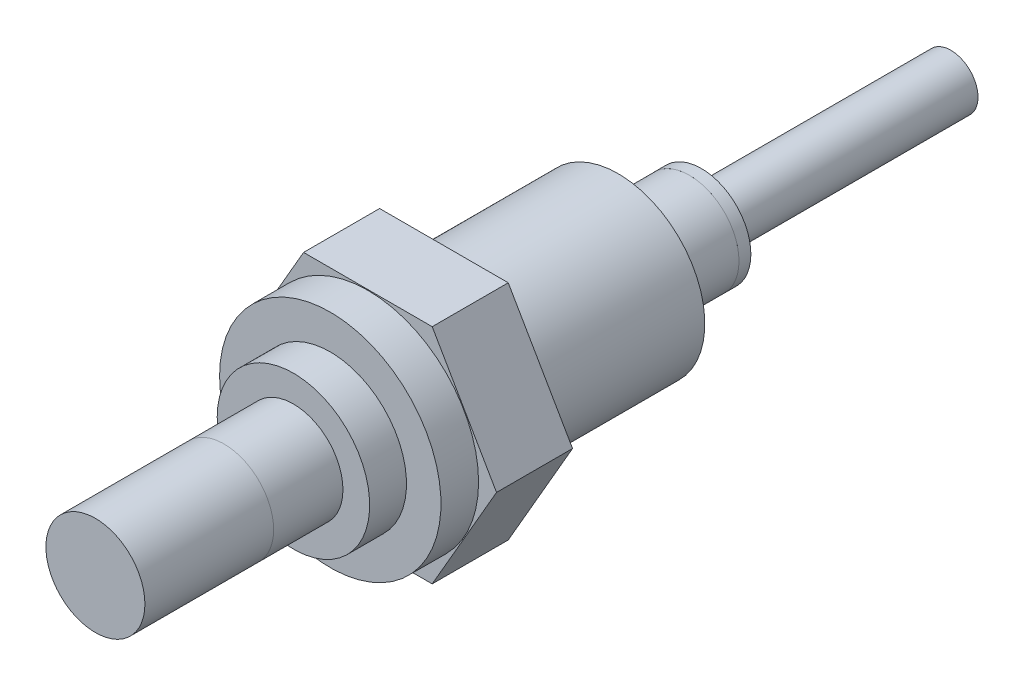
from build123d import *

# Parameters (mm, degrees)
EXTRUDE1_DEPTH     = 4.8768
SKETCH2_W          = 11.176
SKETCH2_H          = 5.55625
SKETCH4_R          = 3.175
CUT_EXTRUDE1_DEPTH = 24.513463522
SKETCH5_R          = 3.175
SKETCH5_R_2        = 1.7526
EXTRUDE2_DEPTH     = 29.845


with BuildPart() as part:
    # Sketch1 → Extrude1 (new body)
    with BuildSketch(Plane.XY):
        Polygon((8.248891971, 0), (4.124445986, 7.14375), (-4.124445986, 7.14375), (-8.248891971, 0), (-4.124445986, -7.14375), (4.124445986, -7.14375), align=None)
    extrude(amount=EXTRUDE1_DEPTH)

    # Sketch3 → Revolve2 (revolve)
    with BuildSketch(Plane(origin=(0, 0, 0), x_dir=(0, 0, -1), z_dir=(1, 0, 0)), mode=Mode.PRIVATE) as revolve2_sk:
        Polygon((-4.8768, 7.0993), (-7.2898, 7.0993), (-7.2898, 4.8895), (-9.652, 4.8895), (-9.652, 0), (-4.8768, 0), align=None)
    revolve(revolve2_sk.sketch.rotate(Axis((0, 0, 0), (0, 0, 1)), 90), axis=Axis((0, 0, 0), (0, 0, 1)))

    # Sketch2 → Revolve1 (revolve)
    with BuildSketch(Plane(origin=(0, 0, 0), x_dir=(0, 0, -1), z_dir=(1, 0, 0)), mode=Mode.PRIVATE) as revolve1_sk:
        with Locations((5.588, 2.778125)):
            Rectangle(SKETCH2_W, SKETCH2_H)
    revolve(revolve1_sk.sketch.rotate(Axis((0, 0, 0), (0, 0, 1)), 90), axis=Axis((0, 0, 0), (0, 0, 1)))

    # Sketch4 → Cut-Extrude1 (cut, through all)
    with BuildSketch(Plane.XY.offset(9.652)):
        Circle(SKETCH4_R)
    extrude(amount=-CUT_EXTRUDE1_DEPTH, mode=Mode.SUBTRACT)


with BuildPart() as body_2:
    # Sketch5 → Extrude2 (new body)
    with BuildSketch(Plane.XY.offset(14.097)):
        Circle(SKETCH5_R)
        Circle(SKETCH5_R_2, mode=Mode.SUBTRACT)
    extrude(amount=-EXTRUDE2_DEPTH)


with BuildPart() as body_3:
    # Sketch6 → Revolve3 (revolve)
    with BuildSketch(Plane(origin=(0, 0, 0), x_dir=(0, 0, -1), z_dir=(1, 0, 0)), mode=Mode.PRIVATE) as revolve3_sk:
        Polygon((-14.097, 3.175), (-22.352, 3.175), (-22.352, 0), (32.512, 0), (32.512, 1.7399), (16.51, 1.7399), (16.51, 3.175), (15.748, 3.175), (15.748, 1.7526), (-14.097, 1.7526), align=None)
    revolve(revolve3_sk.sketch.rotate(Axis((0, 0, 22.352), (0, 0, -1)), 90), axis=Axis((0, 0, 22.352), (0, 0, -1)))


solid = Compound([part.part, body_2.part, body_3.part])
